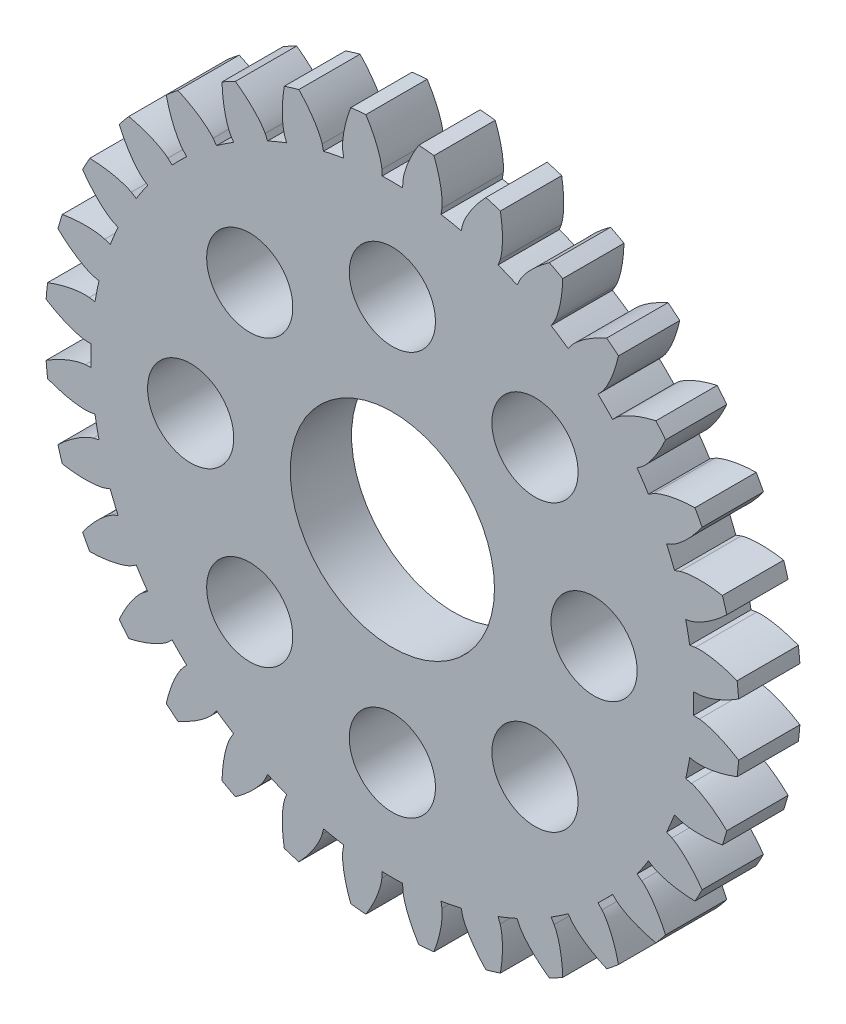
from build123d import *

# Parameters (mm, degrees)
EXTRUDE_1208_DEPTH          = 3
SKETCH_1293_R               = 49.569286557
SKETCH_1293_R_2             = 17
CUT_EXTRUDE_1634_DEPTH      = 53.206643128
CUT_EXTRUDE_2154_DEPTH      = 25.193386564
PATTERN_CIRCULAR_2257_COUNT = 32
SKETCH_2317_R               = 14.75
EXTRUDE_2640_DEPTH          = 3
SKETCH_3388_R               = 5
CUT_EXTRUDE_4039_DEPTH      = 25.158640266
SKETCH_2_R                  = 2.10975
CUT_EXTRUDE_1_DEPTH         = 25.158640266


with BuildPart() as part:
    # Sketch 1026 → Extrude 1208 (new body)
    with BuildSketch(Plane.XY):
        with BuildLine():
            Line((-46.692684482, -16.640534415), (0.513826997, -15.026299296))
            Line((0.513826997, -15.026299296), (0, 0))
            Line((0, 0), (0, 14.741383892))
            Line((0, 14.741383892), (-0.504084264, 14.741383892))
            Line((-0.504084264, 14.741383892), (-0.513826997, 15.026299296))
            add(Edge.make_bspline(
                [(-0.513826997, 15.026299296), (-0.515889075, 15.054831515), (-0.521761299, 15.111691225), (-0.540389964, 15.224595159), (-0.589193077, 15.436727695), (-0.675892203, 15.716023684), (-0.880469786, 16.231671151), (-1.297005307, 17.009555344), (-1.993063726, 17.973877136), (-3.148931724, 19.167799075), (-4.697413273, 20.348940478), (-6.567203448, 21.388631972), (-8.716985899, 22.219988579), (-10.951838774, 22.778990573), (-13.2347336, 23.082012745), (-15.649996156, 23.14779345), (-18.633230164, 22.91706654), (-22.131572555, 22.187568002), (-26.030647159, 20.755253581), (-30.063654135, 18.514112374), (-33.730827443, 15.7177416), (-36.579001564, 12.861318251), (-38.742827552, 10.170685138), (-40.354672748, 7.790343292), (-41.527356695, 5.81198096), (-42.845474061, 3.25754218), (-43.965005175, 0.607443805), (-44.884776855, -2.117401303), (-45.749527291, -5.457144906), (-46.219817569, -8.001288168), (-46.500586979, -10.286314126), (-46.645085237, -12.289435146), (-46.691895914, -13.300248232), (-46.714786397, -14.149099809), (-46.721252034, -14.931849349), (-46.72042047, -15.537746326), (-46.708127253, -16.132545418), (-46.698424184, -16.472683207), (-46.692684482, -16.640534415)],
                knots=[0, 0, 0, 0, 0, 0.001401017, 0.002802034, 0.005604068, 0.010661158, 0.015718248, 0.029959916, 0.048733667, 0.068727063, 0.096888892, 0.125050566, 0.153212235, 0.18137365, 0.209534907, 0.23769631, 0.271429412, 0.327752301, 0.384075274, 0.440398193, 0.496721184, 0.553044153, 0.581205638, 0.609367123, 0.637528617, 0.665690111, 0.72201302, 0.750174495, 0.77833597, 0.834658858, 0.848739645, 0.862820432, 0.876901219, 0.883941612, 0.890982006, 0.90003647, 0.909090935, 0.909090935, 0.909090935, 0.909090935, 0.909090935], degree=4))
        make_face()
    extrude(amount=EXTRUDE_1208_DEPTH)

    # Mirror 1254: part across plane


with BuildPart() as part_1:
    add(part.part)
    add(part.part.mirror(Plane(origin=(0, 0, 3), x_dir=(0, 0, 1), z_dir=(1, 0, 0))))

    # Sketch 1293 → Cut-Extrude 1634 (cut, through all)
    with BuildSketch(Plane.XY.offset(3)):
        Circle(SKETCH_1293_R)
        Circle(SKETCH_1293_R_2, mode=Mode.SUBTRACT)
    extrude(amount=-CUT_EXTRUDE_1634_DEPTH, mode=Mode.SUBTRACT)

    # Sketch 1794 → Cut-Extrude 2154 (cut, through all)
    with BuildSketch(Plane.XY.offset(3)):
        with BuildLine():
            Line((-1.666291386, 16.918140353), (0, 0))
            Line((0, 0), (1.666291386, 16.918140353))
            ThreePointArc((1.666291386, 16.918140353), (0, -17), (-1.666291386, 16.918140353))
        make_face()
    extrude(amount=-CUT_EXTRUDE_2154_DEPTH, mode=Mode.SUBTRACT)


with BuildPart() as pattern_circular_2257_1:
    # Pattern Circular 2257: pattern copy
    add(part_1.part.rotate(Axis((0, 0, 0), (0, 0, 1)), 1 * 360 / PATTERN_CIRCULAR_2257_COUNT))


with BuildPart() as pattern_circular_2257_2:
    # Pattern Circular 2257: pattern copy
    add(part_1.part.rotate(Axis((0, 0, 0), (0, 0, 1)), 2 * 360 / PATTERN_CIRCULAR_2257_COUNT))


with BuildPart() as pattern_circular_2257_3:
    # Pattern Circular 2257: pattern copy
    add(part_1.part.rotate(Axis((0, 0, 0), (0, 0, 1)), 3 * 360 / PATTERN_CIRCULAR_2257_COUNT))


with BuildPart() as pattern_circular_2257_4:
    # Pattern Circular 2257: pattern copy
    add(part_1.part.rotate(Axis((0, 0, 0), (0, 0, 1)), 4 * 360 / PATTERN_CIRCULAR_2257_COUNT))


with BuildPart() as pattern_circular_2257_5:
    # Pattern Circular 2257: pattern copy
    add(part_1.part.rotate(Axis((0, 0, 0), (0, 0, 1)), 5 * 360 / PATTERN_CIRCULAR_2257_COUNT))


with BuildPart() as pattern_circular_2257_6:
    # Pattern Circular 2257: pattern copy
    add(part_1.part.rotate(Axis((0, 0, 0), (0, 0, 1)), 6 * 360 / PATTERN_CIRCULAR_2257_COUNT))


with BuildPart() as pattern_circular_2257_7:
    # Pattern Circular 2257: pattern copy
    add(part_1.part.rotate(Axis((0, 0, 0), (0, 0, 1)), 7 * 360 / PATTERN_CIRCULAR_2257_COUNT))


with BuildPart() as pattern_circular_2257_8:
    # Pattern Circular 2257: pattern copy
    add(part_1.part.rotate(Axis((0, 0, 0), (0, 0, 1)), 8 * 360 / PATTERN_CIRCULAR_2257_COUNT))


with BuildPart() as pattern_circular_2257_9:
    # Pattern Circular 2257: pattern copy
    add(part_1.part.rotate(Axis((0, 0, 0), (0, 0, 1)), 9 * 360 / PATTERN_CIRCULAR_2257_COUNT))


with BuildPart() as pattern_circular_2257_10:
    # Pattern Circular 2257: pattern copy
    add(part_1.part.rotate(Axis((0, 0, 0), (0, 0, 1)), 10 * 360 / PATTERN_CIRCULAR_2257_COUNT))


with BuildPart() as pattern_circular_2257_11:
    # Pattern Circular 2257: pattern copy
    add(part_1.part.rotate(Axis((0, 0, 0), (0, 0, 1)), 11 * 360 / PATTERN_CIRCULAR_2257_COUNT))


with BuildPart() as pattern_circular_2257_12:
    # Pattern Circular 2257: pattern copy
    add(part_1.part.rotate(Axis((0, 0, 0), (0, 0, 1)), 12 * 360 / PATTERN_CIRCULAR_2257_COUNT))


with BuildPart() as pattern_circular_2257_13:
    # Pattern Circular 2257: pattern copy
    add(part_1.part.rotate(Axis((0, 0, 0), (0, 0, 1)), 13 * 360 / PATTERN_CIRCULAR_2257_COUNT))


with BuildPart() as pattern_circular_2257_14:
    # Pattern Circular 2257: pattern copy
    add(part_1.part.rotate(Axis((0, 0, 0), (0, 0, 1)), 14 * 360 / PATTERN_CIRCULAR_2257_COUNT))


with BuildPart() as pattern_circular_2257_15:
    # Pattern Circular 2257: pattern copy
    add(part_1.part.rotate(Axis((0, 0, 0), (0, 0, 1)), 15 * 360 / PATTERN_CIRCULAR_2257_COUNT))


with BuildPart() as pattern_circular_2257_16:
    # Pattern Circular 2257: pattern copy
    add(part_1.part.rotate(Axis((0, 0, 0), (0, 0, 1)), 16 * 360 / PATTERN_CIRCULAR_2257_COUNT))


with BuildPart() as pattern_circular_2257_17:
    # Pattern Circular 2257: pattern copy
    add(part_1.part.rotate(Axis((0, 0, 0), (0, 0, 1)), 17 * 360 / PATTERN_CIRCULAR_2257_COUNT))


with BuildPart() as pattern_circular_2257_18:
    # Pattern Circular 2257: pattern copy
    add(part_1.part.rotate(Axis((0, 0, 0), (0, 0, 1)), 18 * 360 / PATTERN_CIRCULAR_2257_COUNT))


with BuildPart() as pattern_circular_2257_19:
    # Pattern Circular 2257: pattern copy
    add(part_1.part.rotate(Axis((0, 0, 0), (0, 0, 1)), 19 * 360 / PATTERN_CIRCULAR_2257_COUNT))


with BuildPart() as pattern_circular_2257_20:
    # Pattern Circular 2257: pattern copy
    add(part_1.part.rotate(Axis((0, 0, 0), (0, 0, 1)), 20 * 360 / PATTERN_CIRCULAR_2257_COUNT))


with BuildPart() as pattern_circular_2257_21:
    # Pattern Circular 2257: pattern copy
    add(part_1.part.rotate(Axis((0, 0, 0), (0, 0, 1)), 21 * 360 / PATTERN_CIRCULAR_2257_COUNT))


with BuildPart() as pattern_circular_2257_22:
    # Pattern Circular 2257: pattern copy
    add(part_1.part.rotate(Axis((0, 0, 0), (0, 0, 1)), 22 * 360 / PATTERN_CIRCULAR_2257_COUNT))


with BuildPart() as pattern_circular_2257_23:
    # Pattern Circular 2257: pattern copy
    add(part_1.part.rotate(Axis((0, 0, 0), (0, 0, 1)), 23 * 360 / PATTERN_CIRCULAR_2257_COUNT))


with BuildPart() as pattern_circular_2257_24:
    # Pattern Circular 2257: pattern copy
    add(part_1.part.rotate(Axis((0, 0, 0), (0, 0, 1)), 24 * 360 / PATTERN_CIRCULAR_2257_COUNT))


with BuildPart() as pattern_circular_2257_25:
    # Pattern Circular 2257: pattern copy
    add(part_1.part.rotate(Axis((0, 0, 0), (0, 0, 1)), 25 * 360 / PATTERN_CIRCULAR_2257_COUNT))


with BuildPart() as pattern_circular_2257_26:
    # Pattern Circular 2257: pattern copy
    add(part_1.part.rotate(Axis((0, 0, 0), (0, 0, 1)), 26 * 360 / PATTERN_CIRCULAR_2257_COUNT))


with BuildPart() as pattern_circular_2257_27:
    # Pattern Circular 2257: pattern copy
    add(part_1.part.rotate(Axis((0, 0, 0), (0, 0, 1)), 27 * 360 / PATTERN_CIRCULAR_2257_COUNT))


with BuildPart() as pattern_circular_2257_28:
    # Pattern Circular 2257: pattern copy
    add(part_1.part.rotate(Axis((0, 0, 0), (0, 0, 1)), 28 * 360 / PATTERN_CIRCULAR_2257_COUNT))


with BuildPart() as pattern_circular_2257_29:
    # Pattern Circular 2257: pattern copy
    add(part_1.part.rotate(Axis((0, 0, 0), (0, 0, 1)), 29 * 360 / PATTERN_CIRCULAR_2257_COUNT))


with BuildPart() as pattern_circular_2257_30:
    # Pattern Circular 2257: pattern copy
    add(part_1.part.rotate(Axis((0, 0, 0), (0, 0, 1)), 30 * 360 / PATTERN_CIRCULAR_2257_COUNT))


with BuildPart() as pattern_circular_2257_31:
    # Pattern Circular 2257: pattern copy
    add(part_1.part.rotate(Axis((0, 0, 0), (0, 0, 1)), 31 * 360 / PATTERN_CIRCULAR_2257_COUNT))


with BuildPart() as part_2:
    add(part_1.part)

    add(pattern_circular_2257_1.part)  # Extrude 2640 merges Pattern Circular 2257_1

    add(pattern_circular_2257_2.part)  # Extrude 2640 merges Pattern Circular 2257_2

    add(pattern_circular_2257_3.part)  # Extrude 2640 merges Pattern Circular 2257_3

    add(pattern_circular_2257_4.part)  # Extrude 2640 merges Pattern Circular 2257_4

    add(pattern_circular_2257_5.part)  # Extrude 2640 merges Pattern Circular 2257_5

    add(pattern_circular_2257_6.part)  # Extrude 2640 merges Pattern Circular 2257_6

    add(pattern_circular_2257_7.part)  # Extrude 2640 merges Pattern Circular 2257_7

    add(pattern_circular_2257_8.part)  # Extrude 2640 merges Pattern Circular 2257_8

    add(pattern_circular_2257_9.part)  # Extrude 2640 merges Pattern Circular 2257_9

    add(pattern_circular_2257_10.part)  # Extrude 2640 merges Pattern Circular 2257_10

    add(pattern_circular_2257_11.part)  # Extrude 2640 merges Pattern Circular 2257_11

    add(pattern_circular_2257_12.part)  # Extrude 2640 merges Pattern Circular 2257_12

    add(pattern_circular_2257_13.part)  # Extrude 2640 merges Pattern Circular 2257_13

    add(pattern_circular_2257_14.part)  # Extrude 2640 merges Pattern Circular 2257_14

    add(pattern_circular_2257_15.part)  # Extrude 2640 merges Pattern Circular 2257_15

    add(pattern_circular_2257_16.part)  # Extrude 2640 merges Pattern Circular 2257_16

    add(pattern_circular_2257_17.part)  # Extrude 2640 merges Pattern Circular 2257_17

    add(pattern_circular_2257_18.part)  # Extrude 2640 merges Pattern Circular 2257_18

    add(pattern_circular_2257_19.part)  # Extrude 2640 merges Pattern Circular 2257_19

    add(pattern_circular_2257_20.part)  # Extrude 2640 merges Pattern Circular 2257_20

    add(pattern_circular_2257_21.part)  # Extrude 2640 merges Pattern Circular 2257_21

    add(pattern_circular_2257_22.part)  # Extrude 2640 merges Pattern Circular 2257_22

    add(pattern_circular_2257_23.part)  # Extrude 2640 merges Pattern Circular 2257_23

    add(pattern_circular_2257_24.part)  # Extrude 2640 merges Pattern Circular 2257_24

    add(pattern_circular_2257_25.part)  # Extrude 2640 merges Pattern Circular 2257_25

    add(pattern_circular_2257_26.part)  # Extrude 2640 merges Pattern Circular 2257_26

    add(pattern_circular_2257_27.part)  # Extrude 2640 merges Pattern Circular 2257_27

    add(pattern_circular_2257_28.part)  # Extrude 2640 merges Pattern Circular 2257_28

    add(pattern_circular_2257_29.part)  # Extrude 2640 merges Pattern Circular 2257_29

    add(pattern_circular_2257_30.part)  # Extrude 2640 merges Pattern Circular 2257_30

    add(pattern_circular_2257_31.part)  # Extrude 2640 merges Pattern Circular 2257_31
    # Sketch 2317 → Extrude 2640 (add, through all)
    with BuildSketch(Plane.XY.offset(3)):
        Circle(SKETCH_2317_R)
    extrude(amount=-EXTRUDE_2640_DEPTH)

    # Sketch 3388 → Cut-Extrude 4039 (cut, through all)
    with BuildSketch(Plane.XY.offset(3)):
        Circle(SKETCH_3388_R)
    extrude(amount=-CUT_EXTRUDE_4039_DEPTH, mode=Mode.SUBTRACT)

    # Sketch 2 → Cut-Extrude 1 (cut, through all)
    with BuildSketch(Plane(origin=(0, 0, 0), x_dir=(-1, 0, 0), z_dir=(0, 0, -1))):
        with Locations((0, -9.875)):
            Circle(SKETCH_2_R)
        with Locations((-6.982679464, -6.982679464)):
            Circle(SKETCH_2_R)
        with Locations((-9.875, 0)):
            Circle(SKETCH_2_R)
        with Locations((-6.982679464, 6.982679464)):
            Circle(SKETCH_2_R)
        with Locations((0, 9.875)):
            Circle(SKETCH_2_R)
        with Locations((6.982679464, 6.982679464)):
            Circle(SKETCH_2_R)
        with Locations((9.875, 0)):
            Circle(SKETCH_2_R)
        with Locations((6.982679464, -6.982679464)):
            Circle(SKETCH_2_R)
    extrude(amount=-CUT_EXTRUDE_1_DEPTH, mode=Mode.SUBTRACT)


solid = part_2.part
